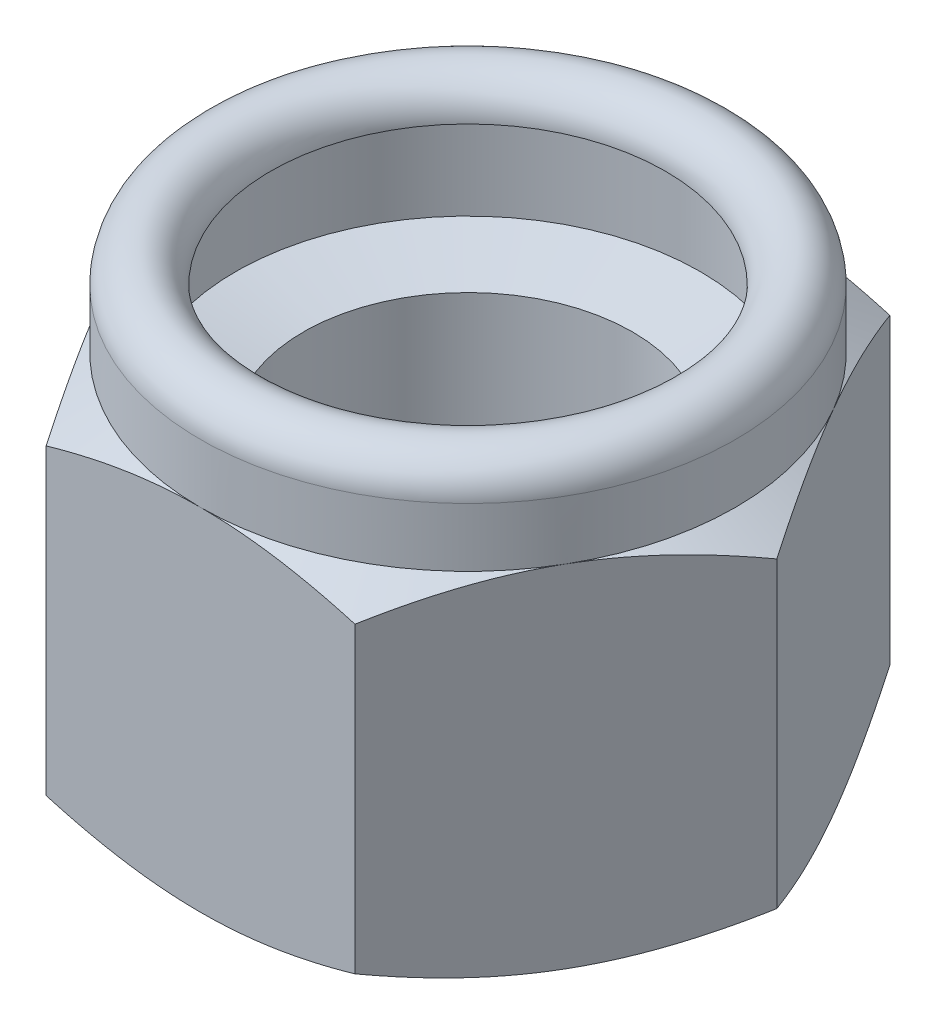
from build123d import *

# Parameters (mm, degrees)
ESQUISSE2_OUTSIDE_W     = 26.014
ESQUISSE2_OUTSIDE_H     = 26.014
ENL_V_MAT_EXTRU_2_DEPTH = 17.900887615


with BuildPart() as part:
    # Esquisse1 → Base-R_volution (revolve)
    with BuildSketch(Plane.XY, mode=Mode.PRIVATE) as base_r_volution_sk:
        with BuildLine():
            Line((4.8, 9.950000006), (5.649999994, 9.950000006))
            Line((5.649999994, 9.950000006), (5.649999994, 7.409858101))
            Line((5.649999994, 7.409858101), (4, 6.967741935))
            Line((4, 6.967741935), (4, 0))
            Line((4, 0), (6.5, 0))
            Line((6.5, 0), (9.192388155, 1.554451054))
            Line((9.192388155, 1.554451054), (9.192388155, 6.967741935))
            Line((9.192388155, 6.967741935), (6.499999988, 8.522192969))
            Line((6.499999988, 8.522192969), (6.499999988, 9.950000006))
            ThreePointArc((6.499999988, 9.950000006), (5.649999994, 10.8), (4.8, 9.950000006))
        make_face()
    revolve(base_r_volution_sk.sketch.rotate(Axis((0, 0, 0), (0, 1, 0)), 90), axis=Axis((0, 0, 0), (0, 1, 0)))

    # Esquisse2 outside → Enl_v. mat.-Extru.2 (cut, through all)
    with BuildSketch(Plane(origin=(0, 0, 0), x_dir=(1, 0, 0), z_dir=(0, 1, 0))):
        Rectangle(ESQUISSE2_OUTSIDE_W, ESQUISSE2_OUTSIDE_H)
        Polygon((-3.75277675, 6.5), (3.75277675, 6.5), (7.505553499, 0), (3.75277675, -6.5), (-3.75277675, -6.5), (-7.505553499, 0), align=None, mode=Mode.SUBTRACT)
    extrude(amount=ENL_V_MAT_EXTRU_2_DEPTH, mode=Mode.SUBTRACT)


solid = part.part
